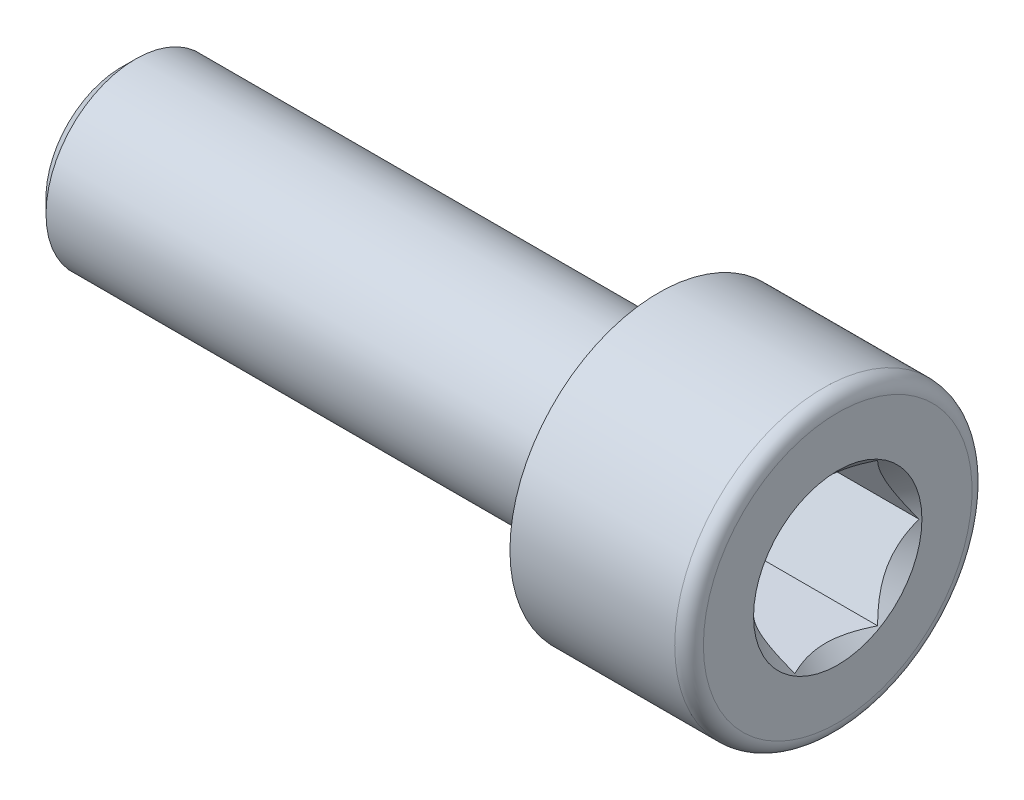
ISO-10303-21;
HEADER;
FILE_DESCRIPTION(('STEP AP214'),'2;1');
FILE_NAME('part.step','',(''),(''),'','','');
FILE_SCHEMA(('AUTOMOTIVE_DESIGN { 1 0 10303 214 1 1 1 1 }'));
ENDSEC;
DATA;
#1=APPLICATION_CONTEXT('core data for automotive mechanical design processes');
#2=APPLICATION_PROTOCOL_DEFINITION('international standard','automotive_design',2000,#1);
#3=PRODUCT_CONTEXT('',#1,'mechanical');
#4=PRODUCT('Part','Part','',(#3));
#5=PRODUCT_RELATED_PRODUCT_CATEGORY('part','',(#4));
#6=PRODUCT_DEFINITION_FORMATION('','',#4);
#7=PRODUCT_DEFINITION_CONTEXT('part definition',#1,'design');
#8=PRODUCT_DEFINITION('design','',#6,#7);
#9=PRODUCT_DEFINITION_SHAPE('','',#8);
#10=(LENGTH_UNIT() NAMED_UNIT(*) SI_UNIT(.MILLI.,.METRE.));
#11=(NAMED_UNIT(*) PLANE_ANGLE_UNIT() SI_UNIT($,.RADIAN.));
#12=(NAMED_UNIT(*) SI_UNIT($,.STERADIAN.) SOLID_ANGLE_UNIT());
#13=UNCERTAINTY_MEASURE_WITH_UNIT(LENGTH_MEASURE(1.E-05),#10,'distance_accuracy_value','');
#14=(GEOMETRIC_REPRESENTATION_CONTEXT(3) GLOBAL_UNCERTAINTY_ASSIGNED_CONTEXT((#13)) GLOBAL_UNIT_ASSIGNED_CONTEXT((#10,
#11,#12)) REPRESENTATION_CONTEXT('',''));
#15=CARTESIAN_POINT('',(0.,0.,0.));
#16=DIRECTION('',(0.,0.,1.));
#17=DIRECTION('',(1.,0.,0.));
#18=AXIS2_PLACEMENT_3D('',#15,#16,#17);
#19=CARTESIAN_POINT('',(-30.,0.,0.));
#20=DIRECTION('',(-1.,0.,0.));
#21=DIRECTION('',(0.,0.,1.));
#22=AXIS2_PLACEMENT_3D('',#19,#20,#21);
#23=CYLINDRICAL_SURFACE('',#22,2.5);
#24=CARTESIAN_POINT('',(-14.5999999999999,0.,0.));
#25=DIRECTION('',(1.,0.,0.));
#26=DIRECTION('',(0.,0.,-1.));
#27=AXIS2_PLACEMENT_3D('',#24,#25,#26);
#28=CIRCLE('',#27,2.5);
#29=CARTESIAN_POINT('',(-14.5999999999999,0.,2.49999999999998));
#30=VERTEX_POINT('',#29);
#31=EDGE_CURVE('E11',#30,#30,#28,.T.);
#32=CARTESIAN_POINT('',(0.,0.,0.));
#33=DIRECTION('',(-1.,0.,0.));
#34=DIRECTION('',(0.,0.,1.));
#35=AXIS2_PLACEMENT_3D('',#32,#33,#34);
#36=CIRCLE('',#35,2.5);
#37=CARTESIAN_POINT('',(0.,0.,2.49999999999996));
#38=VERTEX_POINT('',#37);
#39=EDGE_CURVE('E445',#38,#38,#36,.T.);
#40=CARTESIAN_POINT('',(-14.5999999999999,0.,2.49999999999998));
#41=CARTESIAN_POINT('',(-14.4479166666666,0.,2.49999999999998));
#42=CARTESIAN_POINT('',(-14.2958333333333,0.,2.49999999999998));
#43=CARTESIAN_POINT('',(-13.9916666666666,0.,2.49999999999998));
#44=CARTESIAN_POINT('',(-13.8395833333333,0.,2.49999999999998));
#45=CARTESIAN_POINT('',(-13.5354166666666,0.,2.49999999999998));
#46=CARTESIAN_POINT('',(-13.3833333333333,0.,2.49999999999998));
#47=CARTESIAN_POINT('',(-13.0791666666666,0.,2.49999999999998));
#48=CARTESIAN_POINT('',(-12.9270833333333,0.,2.49999999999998));
#49=CARTESIAN_POINT('',(-12.6229166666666,0.,2.49999999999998));
#50=CARTESIAN_POINT('',(-12.4708333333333,0.,2.49999999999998));
#51=CARTESIAN_POINT('',(-12.1666666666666,0.,2.49999999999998));
#52=CARTESIAN_POINT('',(-12.0145833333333,0.,2.49999999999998));
#53=CARTESIAN_POINT('',(-11.7104166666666,0.,2.49999999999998));
#54=CARTESIAN_POINT('',(-11.5583333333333,0.,2.49999999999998));
#55=CARTESIAN_POINT('',(-11.2541666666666,0.,2.49999999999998));
#56=CARTESIAN_POINT('',(-11.1020833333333,0.,2.49999999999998));
#57=CARTESIAN_POINT('',(-10.7979166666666,0.,2.49999999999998));
#58=CARTESIAN_POINT('',(-10.6458333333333,0.,2.49999999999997));
#59=CARTESIAN_POINT('',(-10.3416666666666,0.,2.49999999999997));
#60=CARTESIAN_POINT('',(-10.1895833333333,0.,2.49999999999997));
#61=CARTESIAN_POINT('',(-9.88541666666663,0.,2.49999999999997));
#62=CARTESIAN_POINT('',(-9.7333333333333,0.,2.49999999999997));
#63=CARTESIAN_POINT('',(-9.42916666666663,0.,2.49999999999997));
#64=CARTESIAN_POINT('',(-9.2770833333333,0.,2.49999999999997));
#65=CARTESIAN_POINT('',(-8.97291666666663,0.,2.49999999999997));
#66=CARTESIAN_POINT('',(-8.8208333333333,0.,2.49999999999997));
#67=CARTESIAN_POINT('',(-8.51666666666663,0.,2.49999999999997));
#68=CARTESIAN_POINT('',(-8.3645833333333,0.,2.49999999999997));
#69=CARTESIAN_POINT('',(-8.06041666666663,0.,2.49999999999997));
#70=CARTESIAN_POINT('',(-7.9083333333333,0.,2.49999999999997));
#71=CARTESIAN_POINT('',(-7.60416666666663,0.,2.49999999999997));
#72=CARTESIAN_POINT('',(-7.4520833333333,0.,2.49999999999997));
#73=CARTESIAN_POINT('',(-7.14791666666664,0.,2.49999999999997));
#74=CARTESIAN_POINT('',(-6.9958333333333,0.,2.49999999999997));
#75=CARTESIAN_POINT('',(-6.69166666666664,0.,2.49999999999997));
#76=CARTESIAN_POINT('',(-6.53958333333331,0.,2.49999999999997));
#77=CARTESIAN_POINT('',(-6.23541666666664,0.,2.49999999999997));
#78=CARTESIAN_POINT('',(-6.08333333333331,0.,2.49999999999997));
#79=CARTESIAN_POINT('',(-5.77916666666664,0.,2.49999999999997));
#80=CARTESIAN_POINT('',(-5.62708333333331,0.,2.49999999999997));
#81=CARTESIAN_POINT('',(-5.32291666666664,0.,2.49999999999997));
#82=CARTESIAN_POINT('',(-5.17083333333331,0.,2.49999999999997));
#83=CARTESIAN_POINT('',(-4.86666666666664,0.,2.49999999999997));
#84=CARTESIAN_POINT('',(-4.71458333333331,0.,2.49999999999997));
#85=CARTESIAN_POINT('',(-4.41041666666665,0.,2.49999999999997));
#86=CARTESIAN_POINT('',(-4.25833333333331,0.,2.49999999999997));
#87=CARTESIAN_POINT('',(-3.95416666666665,0.,2.49999999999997));
#88=CARTESIAN_POINT('',(-3.80208333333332,0.,2.49999999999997));
#89=CARTESIAN_POINT('',(-3.49791666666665,0.,2.49999999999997));
#90=CARTESIAN_POINT('',(-3.34583333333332,0.,2.49999999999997));
#91=CARTESIAN_POINT('',(-3.04166666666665,0.,2.49999999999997));
#92=CARTESIAN_POINT('',(-2.88958333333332,0.,2.49999999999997));
#93=CARTESIAN_POINT('',(-2.58541666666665,0.,2.49999999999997));
#94=CARTESIAN_POINT('',(-2.43333333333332,0.,2.49999999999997));
#95=CARTESIAN_POINT('',(-2.12916666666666,0.,2.49999999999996));
#96=CARTESIAN_POINT('',(-1.97708333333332,0.,2.49999999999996));
#97=CARTESIAN_POINT('',(-1.67291666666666,0.,2.49999999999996));
#98=CARTESIAN_POINT('',(-1.52083333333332,0.,2.49999999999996));
#99=CARTESIAN_POINT('',(-1.21666666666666,0.,2.49999999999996));
#100=CARTESIAN_POINT('',(-1.06458333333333,0.,2.49999999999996));
#101=CARTESIAN_POINT('',(-0.76041666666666,0.,2.49999999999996));
#102=CARTESIAN_POINT('',(-0.608333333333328,0.,2.49999999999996));
#103=CARTESIAN_POINT('',(-0.304166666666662,0.,2.49999999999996));
#104=CARTESIAN_POINT('',(-0.152083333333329,0.,2.49999999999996));
#105=CARTESIAN_POINT('',(0.,0.,2.49999999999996));
#106=B_SPLINE_CURVE_WITH_KNOTS('',3,(#40,#41,#42,#43,#44,#45,#46,#47,#48,#49,#50,#51,#52,#53,
#54,#55,#56,#57,#58,#59,#60,#61,#62,#63,#64,#65,#66,#67,#68,#69,#70,#71,#72,#73,#74,#75,#76,#77,
#78,#79,#80,#81,#82,#83,#84,#85,#86,#87,#88,#89,#90,#91,#92,#93,#94,#95,#96,#97,#98,#99,#100,
#101,#102,#103,#104,#105),.UNSPECIFIED.,.F.,.F.,(4,2,2,2,2,2,2,2,2,2,2,2,2,2,2,2,2,2,2,2,2,2,2,
2,2,2,2,2,2,2,2,2,4),(0.,0.456249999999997,0.912499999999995,1.36874999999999,1.82499999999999,
2.28124999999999,2.73749999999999,3.19374999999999,3.64999999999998,4.10624999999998,
4.56249999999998,5.01874999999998,5.47499999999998,5.93124999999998,6.38749999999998,
6.84374999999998,7.29999999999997,7.75624999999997,8.21249999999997,8.66874999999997,
9.12499999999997,9.58124999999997,10.0375,10.49375,10.95,11.40625,11.8625,12.31875,12.775,
13.23125,13.6875,14.1437499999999,14.5999999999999),.UNSPECIFIED.);
#107=EDGE_CURVE('BSEAM348',#30,#38,#106,.T.);
#108=ORIENTED_EDGE('',*,*,#31,.T.);
#109=ORIENTED_EDGE('',*,*,#39,.T.);
#110=ORIENTED_EDGE('',*,*,#107,.T.);
#111=ORIENTED_EDGE('',*,*,#107,.F.);
#112=EDGE_LOOP('',(#108,#110,#109,#111));
#113=FACE_BOUND('',#112,.T.);
#114=ADVANCED_FACE('F348',(#113),#23,.T.);
#115=CARTESIAN_POINT('',(-14.9999999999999,0.,0.));
#116=DIRECTION('',(1.,0.,0.));
#117=DIRECTION('',(0.,0.,-1.));
#118=AXIS2_PLACEMENT_3D('',#115,#116,#117);
#119=PLANE('',#118);
#120=CARTESIAN_POINT('',(-14.9999999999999,0.,0.));
#121=DIRECTION('',(1.,0.,0.));
#122=DIRECTION('',(0.,0.,-1.));
#123=AXIS2_PLACEMENT_3D('',#120,#121,#122);
#124=CIRCLE('',#123,2.1);
#125=CARTESIAN_POINT('',(-14.9999999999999,0.,-2.1));
#126=VERTEX_POINT('',#125);
#127=EDGE_CURVE('E355',#126,#126,#124,.F.);
#128=ORIENTED_EDGE('',*,*,#127,.T.);
#129=EDGE_LOOP('',(#128));
#130=FACE_BOUND('',#129,.T.);
#131=ADVANCED_FACE('F506',(#130),#119,.F.);
#132=CARTESIAN_POINT('',(4.65000000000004,0.,0.));
#133=DIRECTION('',(1.,0.,0.));
#134=DIRECTION('',(0.,0.,-1.));
#135=AXIS2_PLACEMENT_3D('',#132,#133,#134);
#136=CONICAL_SURFACE('',#135,2.,0.785398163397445);
#137=CARTESIAN_POINT('',(4.99999999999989,0.,0.));
#138=DIRECTION('',(-1.,0.,0.));
#139=DIRECTION('',(0.,0.,1.));
#140=AXIS2_PLACEMENT_3D('',#137,#138,#139);
#141=CIRCLE('',#140,2.35);
#142=CARTESIAN_POINT('',(4.99999999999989,0.,2.35));
#143=VERTEX_POINT('',#142);
#144=EDGE_CURVE('E457',#143,#143,#141,.T.);
#145=ORIENTED_EDGE('',*,*,#144,.F.);
#146=EDGE_LOOP('',(#145));
#147=FACE_BOUND('',#146,.T.);
#148=CARTESIAN_POINT('',(4.95951655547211,-2.0001999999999,1.15458506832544));
#149=CARTESIAN_POINT('',(4.91985416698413,-1.93144696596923,1.19427965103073));
#150=CARTESIAN_POINT('',(4.88252105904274,-1.86154425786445,1.23463799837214));
#151=CARTESIAN_POINT('',(4.81416476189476,-1.71900475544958,1.31693321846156));
#152=CARTESIAN_POINT('',(4.78317961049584,-1.64635440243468,1.35887791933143));
#153=CARTESIAN_POINT('',(4.73010129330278,-1.49985839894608,1.44345742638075));
#154=CARTESIAN_POINT('',(4.70787470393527,-1.42605006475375,1.48607068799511));
#155=CARTESIAN_POINT('',(4.67362989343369,-1.27680836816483,1.5722354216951));
#156=CARTESIAN_POINT('',(4.66158610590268,-1.20137956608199,1.61578426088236));
#157=CARTESIAN_POINT('',(4.65071958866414,-1.07138449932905,1.69083694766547));
#158=CARTESIAN_POINT('',(4.64911083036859,-1.01698621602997,1.7222438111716));
#159=CARTESIAN_POINT('',(4.65181995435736,-0.908278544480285,1.78500621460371));
#160=CARTESIAN_POINT('',(4.65613991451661,-0.853969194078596,1.81636173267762));
#161=CARTESIAN_POINT('',(4.67046064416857,-0.745863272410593,1.87877671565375));
#162=CARTESIAN_POINT('',(4.68046776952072,-0.69206734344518,1.90983580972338));
#163=CARTESIAN_POINT('',(4.7056135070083,-0.585405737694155,1.97141691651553));
#164=CARTESIAN_POINT('',(4.72075172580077,-0.532539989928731,2.00193897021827));
#165=CARTESIAN_POINT('',(4.76569558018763,-0.397120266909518,2.08012358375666));
#166=CARTESIAN_POINT('',(4.79888991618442,-0.315406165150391,2.12730124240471));
#167=CARTESIAN_POINT('',(4.85492689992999,-0.195252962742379,2.19667172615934));
#168=CARTESIAN_POINT('',(4.87461577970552,-0.155657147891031,2.21953238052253));
#169=CARTESIAN_POINT('',(4.91578839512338,-0.0771990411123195,2.26483018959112));
#170=CARTESIAN_POINT('',(4.93727102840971,-0.0383363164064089,2.28726759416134));
#171=CARTESIAN_POINT('',(4.95951655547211,0.000199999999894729,2.30951654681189));
#172=B_SPLINE_CURVE_WITH_KNOTS('',3,(#148,#149,#150,#151,#152,#153,#154,#155,#156,#157,#158,
#159,#160,#161,#162,#163,#164,#165,#166,#167,#168,#169,#170,#171),.UNSPECIFIED.,.F.,.F.,(4,2,2,
2,2,2,2,2,2,2,2,4),(0.,0.266420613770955,0.534393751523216,0.798110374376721,1.06116288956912,
1.24939906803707,1.43770123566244,1.62621426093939,1.81471283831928,2.11415604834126,
2.26347170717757,2.4126962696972),.UNSPECIFIED.);
#173=CARTESIAN_POINT('',(4.95940107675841,-2.,1.15470053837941));
#174=VERTEX_POINT('',#173);
#175=CARTESIAN_POINT('',(4.95940107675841,-2.22044604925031E-13,2.30940107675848));
#176=VERTEX_POINT('',#175);
#177=EDGE_CURVE('E460',#174,#176,#172,.T.);
#178=ORIENTED_EDGE('',*,*,#177,.T.);
#179=CARTESIAN_POINT('',(4.95951655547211,-0.000200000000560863,2.30951654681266));
#180=CARTESIAN_POINT('',(4.91985416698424,0.0685530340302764,2.2698219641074));
#181=CARTESIAN_POINT('',(4.88252105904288,0.13845574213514,2.22946361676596));
#182=CARTESIAN_POINT('',(4.81416476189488,0.280995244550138,2.14716839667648));
#183=CARTESIAN_POINT('',(4.78317961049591,0.353645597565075,2.10522369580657));
#184=CARTESIAN_POINT('',(4.73010129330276,0.500141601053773,2.02064418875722));
#185=CARTESIAN_POINT('',(4.70787470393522,0.573949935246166,1.97803092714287));
#186=CARTESIAN_POINT('',(4.67362989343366,0.723191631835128,1.89186619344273));
#187=CARTESIAN_POINT('',(4.6615861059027,0.798620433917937,1.8483173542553));
#188=CARTESIAN_POINT('',(4.65071958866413,0.928615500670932,1.77326466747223));
#189=CARTESIAN_POINT('',(4.64911083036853,0.98301378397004,1.74185780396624));
#190=CARTESIAN_POINT('',(4.65181995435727,1.09172145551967,1.67909540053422));
#191=CARTESIAN_POINT('',(4.65613991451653,1.14603080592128,1.64773988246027));
#192=CARTESIAN_POINT('',(4.67046064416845,1.25413672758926,1.58532489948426));
#193=CARTESIAN_POINT('',(4.68046776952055,1.30793265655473,1.5542658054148));
#194=CARTESIAN_POINT('',(4.70561350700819,1.41459426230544,1.49268469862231));
#195=CARTESIAN_POINT('',(4.72075172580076,1.46746001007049,1.46216264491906));
#196=CARTESIAN_POINT('',(4.76569558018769,1.60287973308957,1.38397803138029));
#197=CARTESIAN_POINT('',(4.79888991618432,1.68459383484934,1.33680037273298));
#198=CARTESIAN_POINT('',(4.85492689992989,1.80474703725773,1.26742988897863));
#199=CARTESIAN_POINT('',(4.87461577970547,1.8443428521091,1.2445692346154));
#200=CARTESIAN_POINT('',(4.91578839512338,1.92280095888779,1.19927142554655));
#201=CARTESIAN_POINT('',(4.93727102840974,1.96166368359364,1.17683402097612));
#202=CARTESIAN_POINT('',(4.95951655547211,2.0001999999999,1.15458506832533));
#203=B_SPLINE_CURVE_WITH_KNOTS('',3,(#179,#180,#181,#182,#183,#184,#185,#186,#187,#188,#189,
#190,#191,#192,#193,#194,#195,#196,#197,#198,#199,#200,#201,#202),.UNSPECIFIED.,.F.,.F.,(4,2,2,
2,2,2,2,2,2,2,2,4),(0.,0.266420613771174,0.534393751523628,0.798110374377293,1.06116288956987,
1.24939906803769,1.43770123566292,1.62621426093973,1.81471283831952,2.11415604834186,
2.26347170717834,2.41269626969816),.UNSPECIFIED.);
#204=CARTESIAN_POINT('',(4.95940107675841,1.99999999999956,1.15470053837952));
#205=VERTEX_POINT('',#204);
#206=EDGE_CURVE('E362',#176,#205,#203,.T.);
#207=ORIENTED_EDGE('',*,*,#206,.T.);
#208=CARTESIAN_POINT('',(5.79426069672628,1.99999999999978,-2.42618534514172));
#209=CARTESIAN_POINT('',(5.74909013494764,1.99999999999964,-2.36763258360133));
#210=CARTESIAN_POINT('',(5.70431975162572,1.99999999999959,-2.30876620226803));
#211=CARTESIAN_POINT('',(5.61576271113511,1.99999999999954,-2.19027734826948));
#212=CARTESIAN_POINT('',(5.57197628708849,1.99999999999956,-2.13065470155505));
#213=CARTESIAN_POINT('',(5.48525899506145,1.99999999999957,-2.01008896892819));
#214=CARTESIAN_POINT('',(5.44233732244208,1.99999999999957,-1.94913924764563));
#215=CARTESIAN_POINT('',(5.35797202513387,1.99999999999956,-1.82622867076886));
#216=CARTESIAN_POINT('',(5.31652829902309,1.99999999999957,-1.76426788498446));
#217=CARTESIAN_POINT('',(5.23284053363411,1.99999999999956,-1.6351265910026));
#218=CARTESIAN_POINT('',(5.19071746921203,1.99999999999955,-1.56786729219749));
#219=CARTESIAN_POINT('',(5.10907589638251,1.99999999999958,-1.43178830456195));
#220=CARTESIAN_POINT('',(5.06955704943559,1.99999999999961,-1.36296882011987));
#221=CARTESIAN_POINT('',(4.99394415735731,1.99999999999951,-1.22371704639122));
#222=CARTESIAN_POINT('',(4.95784054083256,1.99999999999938,-1.15328999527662));
#223=CARTESIAN_POINT('',(4.8898737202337,1.99999999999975,-1.01043480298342));
#224=CARTESIAN_POINT('',(4.85800850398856,2.00000000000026,-0.938007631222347));
#225=CARTESIAN_POINT('',(4.80263091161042,2.00000000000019,-0.798432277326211));
#226=CARTESIAN_POINT('',(4.77859946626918,1.99999999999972,-0.731492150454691));
#227=CARTESIAN_POINT('',(4.73589336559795,1.9999999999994,-0.595892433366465));
#228=CARTESIAN_POINT('',(4.7172190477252,1.99999999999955,-0.527232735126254));
#229=CARTESIAN_POINT('',(4.68655509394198,1.99999999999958,-0.389808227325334));
#230=CARTESIAN_POINT('',(4.67444297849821,1.99999999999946,-0.321071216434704));
#231=CARTESIAN_POINT('',(4.65715855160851,1.99999999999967,-0.182725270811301));
#232=CARTESIAN_POINT('',(4.65198475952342,2.00000000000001,-0.113116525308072));
#233=CARTESIAN_POINT('',(4.64902612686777,2.,0.023129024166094));
#234=CARTESIAN_POINT('',(4.65091987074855,1.99999999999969,0.0897588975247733));
#235=CARTESIAN_POINT('',(4.66125026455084,1.99999999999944,0.222505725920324));
#236=CARTESIAN_POINT('',(4.66968750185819,1.99999999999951,0.288622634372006));
#237=CARTESIAN_POINT('',(4.69276803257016,1.99999999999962,0.420987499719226));
#238=CARTESIAN_POINT('',(4.70752150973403,1.99999999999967,0.487215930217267));
#239=CARTESIAN_POINT('',(4.74241355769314,1.99999999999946,0.618207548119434));
#240=CARTESIAN_POINT('',(4.7625518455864,1.99999999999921,0.682970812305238));
#241=CARTESIAN_POINT('',(4.8320405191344,1.99999999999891,0.881622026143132));
#242=CARTESIAN_POINT('',(4.88907995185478,1.99999999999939,1.01281050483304));
#243=CARTESIAN_POINT('',(5.01602570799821,1.99999999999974,1.26907436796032));
#244=CARTESIAN_POINT('',(5.08597723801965,1.99999999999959,1.39412625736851));
#245=CARTESIAN_POINT('',(5.19522880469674,1.99999999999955,1.57489943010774));
#246=CARTESIAN_POINT('',(5.23135733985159,1.99999999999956,1.63257625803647));
#247=CARTESIAN_POINT('',(5.30516118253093,1.99999999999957,1.7469394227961));
#248=CARTESIAN_POINT('',(5.34283660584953,1.99999999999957,1.80362568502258));
#249=CARTESIAN_POINT('',(5.41914526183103,1.99999999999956,1.91568151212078));
#250=CARTESIAN_POINT('',(5.45776839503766,1.99999999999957,1.97105798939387));
#251=CARTESIAN_POINT('',(5.53605164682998,1.99999999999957,2.08105092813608));
#252=CARTESIAN_POINT('',(5.57571147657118,1.99999999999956,2.13566759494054));
#253=CARTESIAN_POINT('',(5.61579652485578,1.99999999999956,2.18996553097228));
#254=B_SPLINE_CURVE_WITH_KNOTS('',3,(#208,#209,#210,#211,#212,#213,#214,#215,#216,#217,#218,
#219,#220,#221,#222,#223,#224,#225,#226,#227,#228,#229,#230,#231,#232,#233,#234,#235,#236,#237,
#238,#239,#240,#241,#242,#243,#244,#245,#246,#247,#248,#249,#250,#251,#252,#253),.UNSPECIFIED.,
.F.,.F.,(4,2,2,2,2,2,2,2,2,2,2,2,2,2,2,2,2,2,2,2,2,2,4),(0.,0.221858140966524,0.443768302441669,
0.66738883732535,0.890993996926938,1.12903048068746,1.36703595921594,1.6043533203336,
1.84155761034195,2.05474341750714,2.26794265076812,2.47701207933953,2.68603688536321,
2.88567400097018,3.08532903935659,3.28861875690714,3.49189779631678,3.91981303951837,
4.34925589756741,4.55341049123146,4.75758039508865,4.96011357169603,5.16259090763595),.UNSPECIFIED.);
#255=CARTESIAN_POINT('',(4.95940107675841,1.99999999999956,-1.15470053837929));
#256=VERTEX_POINT('',#255);
#257=EDGE_CURVE('E496',#205,#256,#254,.F.);
#258=ORIENTED_EDGE('',*,*,#257,.T.);
#259=CARTESIAN_POINT('',(4.95951655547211,2.00019999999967,-1.15458506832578));
#260=CARTESIAN_POINT('',(4.91985416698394,1.93144696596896,-1.19427965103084));
#261=CARTESIAN_POINT('',(4.88252105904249,1.86154425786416,-1.23463799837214));
#262=CARTESIAN_POINT('',(4.81416476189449,1.71900475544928,-1.31693321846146));
#263=CARTESIAN_POINT('',(4.78317961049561,1.6463544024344,-1.35887791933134));
#264=CARTESIAN_POINT('',(4.73010129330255,1.49985839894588,-1.44345742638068));
#265=CARTESIAN_POINT('',(4.70787470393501,1.42605006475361,-1.48607068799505));
#266=CARTESIAN_POINT('',(4.67362989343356,1.27680836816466,-1.5722354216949));
#267=CARTESIAN_POINT('',(4.66158610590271,1.20137956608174,-1.61578426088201));
#268=CARTESIAN_POINT('',(4.65071958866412,1.07138449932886,-1.69083694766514));
#269=CARTESIAN_POINT('',(4.64911083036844,1.01698621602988,-1.72224381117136));
#270=CARTESIAN_POINT('',(4.65181995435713,0.908278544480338,-1.78500621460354));
#271=CARTESIAN_POINT('',(4.65613991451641,0.853969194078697,-1.81636173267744));
#272=CARTESIAN_POINT('',(4.67046064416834,0.745863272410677,-1.87877671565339));
#273=CARTESIAN_POINT('',(4.68046776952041,0.692067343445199,-1.90983580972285));
#274=CARTESIAN_POINT('',(4.7056135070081,0.585405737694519,-1.9714169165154));
#275=CARTESIAN_POINT('',(4.72075172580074,0.532539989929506,-2.0019389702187));
#276=CARTESIAN_POINT('',(4.76569558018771,0.397120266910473,-2.08012358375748));
#277=CARTESIAN_POINT('',(4.79888991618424,0.315406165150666,-2.1273012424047));
#278=CARTESIAN_POINT('',(4.85492689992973,0.195252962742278,-2.196671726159));
#279=CARTESIAN_POINT('',(4.87461577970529,0.155657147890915,-2.21953238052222));
#280=CARTESIAN_POINT('',(4.91578839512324,0.0771990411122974,-2.26483018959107));
#281=CARTESIAN_POINT('',(4.93727102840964,0.0383363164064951,-2.28726759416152));
#282=CARTESIAN_POINT('',(4.95951655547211,-0.000199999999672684,-2.30951654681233));
#283=B_SPLINE_CURVE_WITH_KNOTS('',3,(#259,#260,#261,#262,#263,#264,#265,#266,#267,#268,#269,
#270,#271,#272,#273,#274,#275,#276,#277,#278,#279,#280,#281,#282),.UNSPECIFIED.,.F.,.F.,(4,2,2,
2,2,2,2,2,2,2,2,4),(0.,0.266420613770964,0.534393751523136,0.798110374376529,1.06116288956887,
1.24939906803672,1.43770123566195,1.62621426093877,1.81471283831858,2.11415604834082,
2.26347170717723,2.41269626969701),.UNSPECIFIED.);
#284=CARTESIAN_POINT('',(4.95940107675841,2.22044604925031E-13,-2.30940107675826));
#285=VERTEX_POINT('',#284);
#286=EDGE_CURVE('E560',#256,#285,#283,.T.);
#287=ORIENTED_EDGE('',*,*,#286,.T.);
#288=CARTESIAN_POINT('',(4.95951655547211,0.000199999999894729,-2.30951654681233));
#289=CARTESIAN_POINT('',(4.91985416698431,-0.0685530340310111,-2.26982196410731));
#290=CARTESIAN_POINT('',(4.88252105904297,-0.138455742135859,-2.22946361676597));
#291=CARTESIAN_POINT('',(4.81416476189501,-0.280995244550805,-2.14716839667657));
#292=CARTESIAN_POINT('',(4.78317961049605,-0.353645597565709,-2.10522369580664));
#293=CARTESIAN_POINT('',(4.73010129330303,-0.500141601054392,-2.02064418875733));
#294=CARTESIAN_POINT('',(4.7078747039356,-0.573949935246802,-1.97803092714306));
#295=CARTESIAN_POINT('',(4.67362989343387,-0.723191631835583,-1.89186619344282));
#296=CARTESIAN_POINT('',(4.66158610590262,-0.798620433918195,-1.84831735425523));
#297=CARTESIAN_POINT('',(4.65071958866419,-0.928615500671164,-1.77326466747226));
#298=CARTESIAN_POINT('',(4.64911083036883,-0.983013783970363,-1.74185780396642));
#299=CARTESIAN_POINT('',(4.65181995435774,-1.09172145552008,-1.67909540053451));
#300=CARTESIAN_POINT('',(4.65613991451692,-1.14603080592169,-1.64773988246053));
#301=CARTESIAN_POINT('',(4.67046064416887,-1.25413672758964,-1.58532489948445));
#302=CARTESIAN_POINT('',(4.68046776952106,-1.30793265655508,-1.55426580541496));
#303=CARTESIAN_POINT('',(4.70561350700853,-1.41459426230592,-1.49268469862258));
#304=CARTESIAN_POINT('',(4.72075172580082,-1.46746001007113,-1.46216264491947));
#305=CARTESIAN_POINT('',(4.76569558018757,-1.60287973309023,-1.38397803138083));
#306=CARTESIAN_POINT('',(4.79888991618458,-1.68459383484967,-1.33680037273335));
#307=CARTESIAN_POINT('',(4.85492689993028,-1.80474703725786,-1.26742988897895));
#308=CARTESIAN_POINT('',(4.87461577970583,-1.84434285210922,-1.24456923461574));
#309=CARTESIAN_POINT('',(4.91578839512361,-1.92280095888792,-1.19927142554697));
#310=CARTESIAN_POINT('',(4.93727102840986,-1.96166368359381,-1.17683402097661));
#311=CARTESIAN_POINT('',(4.95951655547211,-2.00020000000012,-1.15458506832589));
#312=B_SPLINE_CURVE_WITH_KNOTS('',3,(#288,#289,#290,#291,#292,#293,#294,#295,#296,#297,#298,
#299,#300,#301,#302,#303,#304,#305,#306,#307,#308,#309,#310,#311),.UNSPECIFIED.,.F.,.F.,(4,2,2,
2,2,2,2,2,2,2,2,4),(0.,0.26642061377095,0.534393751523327,0.798110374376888,1.06116288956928,
1.24939906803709,1.43770123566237,1.62621426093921,1.81471283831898,2.1141560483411,
2.26347170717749,2.41269626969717),.UNSPECIFIED.);
#313=CARTESIAN_POINT('',(4.95940107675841,-2.,-1.15470053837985));
#314=VERTEX_POINT('',#313);
#315=EDGE_CURVE('E556',#285,#314,#312,.T.);
#316=ORIENTED_EDGE('',*,*,#315,.T.);
#317=CARTESIAN_POINT('',(5.7942607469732,-2.,-2.42618541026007));
#318=CARTESIAN_POINT('',(5.74909018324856,-2.,-2.36763264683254));
#319=CARTESIAN_POINT('',(5.70431979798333,-1.99999999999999,-2.30876626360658));
#320=CARTESIAN_POINT('',(5.61576275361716,-1.99999999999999,-2.19027740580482));
#321=CARTESIAN_POINT('',(5.57197632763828,-1.99999999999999,-2.13065475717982));
#322=CARTESIAN_POINT('',(5.48525903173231,-1.99999999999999,-2.01008902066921));
#323=CARTESIAN_POINT('',(5.44233735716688,-1.99999999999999,-1.94913929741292));
#324=CARTESIAN_POINT('',(5.35797205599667,-1.99999999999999,-1.82622871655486));
#325=CARTESIAN_POINT('',(5.31652832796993,-1.99999999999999,-1.76426792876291));
#326=CARTESIAN_POINT('',(5.23284055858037,-1.99999999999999,-1.63512663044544));
#327=CARTESIAN_POINT('',(5.19071749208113,-1.99999999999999,-1.56786732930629));
#328=CARTESIAN_POINT('',(5.10907591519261,-1.99999999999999,-1.43178833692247));
#329=CARTESIAN_POINT('',(5.06955706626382,-1.99999999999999,-1.36296885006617));
#330=CARTESIAN_POINT('',(4.99394417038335,-1.99999999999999,-1.22371707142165));
#331=CARTESIAN_POINT('',(4.95784055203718,-1.99999999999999,-1.15329001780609));
#332=CARTESIAN_POINT('',(4.88987372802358,-2.,-1.01043482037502));
#333=CARTESIAN_POINT('',(4.85800851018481,-2.,-0.938007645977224));
#334=CARTESIAN_POINT('',(4.80263091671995,-2.,-0.79843229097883));
#335=CARTESIAN_POINT('',(4.77859947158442,-1.99999999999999,-0.7314921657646));
#336=CARTESIAN_POINT('',(4.73589337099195,-2.,-0.595892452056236));
#337=CARTESIAN_POINT('',(4.71721905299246,-2.00000000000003,-0.527232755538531));
#338=CARTESIAN_POINT('',(4.68655509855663,-1.99999999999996,-0.389808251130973));
#339=CARTESIAN_POINT('',(4.67444298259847,-1.99999999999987,-0.321071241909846));
#340=CARTESIAN_POINT('',(4.65715855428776,-2.00000000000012,-0.182725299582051));
#341=CARTESIAN_POINT('',(4.6519847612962,-2.00000000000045,-0.113116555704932));
#342=CARTESIAN_POINT('',(4.6490261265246,-2.00000000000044,0.0231289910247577));
#343=CARTESIAN_POINT('',(4.65091986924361,-2.00000000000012,0.0897588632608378));
#344=CARTESIAN_POINT('',(4.66125026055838,-1.99999999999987,0.22250568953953));
#345=CARTESIAN_POINT('',(4.66968749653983,-1.99999999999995,0.288622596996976));
#346=CARTESIAN_POINT('',(4.69276802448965,-2.00000000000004,0.420987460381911));
#347=CARTESIAN_POINT('',(4.70752150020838,-2.00000000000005,0.487215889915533));
#348=CARTESIAN_POINT('',(4.74241354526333,-1.99999999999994,0.618207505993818));
#349=CARTESIAN_POINT('',(4.7625518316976,-1.99999999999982,0.682970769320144));
#350=CARTESIAN_POINT('',(4.83204049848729,-1.99999999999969,0.881621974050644));
#351=CARTESIAN_POINT('',(4.88907992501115,-1.99999999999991,1.01281044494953));
#352=CARTESIAN_POINT('',(5.01602566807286,-2.00000000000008,1.26907429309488));
#353=CARTESIAN_POINT('',(5.08597719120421,-2.00000000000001,1.39412617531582));
#354=CARTESIAN_POINT('',(5.19522874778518,-1.99999999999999,1.57489933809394));
#355=CARTESIAN_POINT('',(5.2313572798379,-1.99999999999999,1.63257616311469));
#356=CARTESIAN_POINT('',(5.30516111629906,-2.,1.74693932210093));
#357=CARTESIAN_POINT('',(5.34283653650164,-2.,1.803625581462));
#358=CARTESIAN_POINT('',(5.41914518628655,-1.99999999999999,1.91568140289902));
#359=CARTESIAN_POINT('',(5.45776831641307,-1.99999999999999,1.97105787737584));
#360=CARTESIAN_POINT('',(5.53605156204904,-2.,2.08105081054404));
#361=CARTESIAN_POINT('',(5.57571138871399,-2.,2.13566747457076));
#362=CARTESIAN_POINT('',(5.61579643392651,-2.,2.18996540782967));
#363=B_SPLINE_CURVE_WITH_KNOTS('',3,(#317,#318,#319,#320,#321,#322,#323,#324,#325,#326,#327,
#328,#329,#330,#331,#332,#333,#334,#335,#336,#337,#338,#339,#340,#341,#342,#343,#344,#345,#346,
#347,#348,#349,#350,#351,#352,#353,#354,#355,#356,#357,#358,#359,#360,#361,#362),.UNSPECIFIED.,
.F.,.F.,(4,2,2,2,2,2,2,2,2,2,2,2,2,2,2,2,2,2,2,2,2,2,4),(0.,0.221858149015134,0.443768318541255,
0.667388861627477,0.890994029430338,1.12903052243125,1.36703601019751,1.60435338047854,
1.8415576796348,2.05474348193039,2.26794271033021,2.47701213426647,2.68603693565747,
2.8856740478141,3.08532908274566,3.28861879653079,3.49189783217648,3.91981304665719,
4.3492558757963,4.55341045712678,4.75758034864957,4.96011351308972,5.16259083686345),.UNSPECIFIED.);
#364=EDGE_CURVE('E467',#314,#174,#363,.T.);
#365=ORIENTED_EDGE('',*,*,#364,.T.);
#366=EDGE_LOOP('',(#178,#207,#258,#287,#316,#365));
#367=FACE_BOUND('',#366,.T.);
#368=ADVANCED_FACE('F473',(#147,#367),#136,.F.);
#369=CARTESIAN_POINT('',(5.00000000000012,3.75000000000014,1.11022302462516E-13));
#370=DIRECTION('',(-1.,0.,0.));
#371=DIRECTION('',(0.,0.,1.));
#372=AXIS2_PLACEMENT_3D('',#369,#370,#371);
#373=PLANE('',#372);
#374=CARTESIAN_POINT('',(5.00000000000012,0.,0.));
#375=DIRECTION('',(-1.,0.,0.));
#376=DIRECTION('',(0.,0.,1.));
#377=AXIS2_PLACEMENT_3D('',#374,#375,#376);
#378=CIRCLE('',#377,3.75);
#379=CARTESIAN_POINT('',(5.00000000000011,0.,3.75));
#380=VERTEX_POINT('',#379);
#381=EDGE_CURVE('E454',#380,#380,#378,.T.);
#382=ORIENTED_EDGE('',*,*,#381,.F.);
#383=EDGE_LOOP('',(#382));
#384=FACE_BOUND('',#383,.T.);
#385=ORIENTED_EDGE('',*,*,#144,.T.);
#386=EDGE_LOOP('',(#385));
#387=FACE_BOUND('',#386,.T.);
#388=ADVANCED_FACE('F538',(#384,#387),#373,.F.);
#389=CARTESIAN_POINT('',(4.59999999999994,0.,0.));
#390=DIRECTION('',(-1.,0.,0.));
#391=DIRECTION('',(0.,0.,1.));
#392=AXIS2_PLACEMENT_3D('',#389,#390,#391);
#393=TOROIDAL_SURFACE('',#392,3.75,0.400000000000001);
#394=CARTESIAN_POINT('',(4.59999999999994,0.,0.));
#395=DIRECTION('',(-1.,0.,0.));
#396=DIRECTION('',(0.,0.,1.));
#397=AXIS2_PLACEMENT_3D('',#394,#395,#396);
#398=CIRCLE('',#397,4.15);
#399=CARTESIAN_POINT('',(4.59999999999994,0.,4.14999999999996));
#400=VERTEX_POINT('',#399);
#401=EDGE_CURVE('E451',#400,#400,#398,.T.);
#402=ORIENTED_EDGE('',*,*,#401,.F.);
#403=EDGE_LOOP('',(#402));
#404=FACE_BOUND('',#403,.T.);
#405=ORIENTED_EDGE('',*,*,#381,.T.);
#406=EDGE_LOOP('',(#405));
#407=FACE_BOUND('',#406,.T.);
#408=ADVANCED_FACE('F533',(#404,#407),#393,.T.);
#409=CARTESIAN_POINT('',(-30.,0.,0.));
#410=DIRECTION('',(-1.,0.,0.));
#411=DIRECTION('',(0.,0.,1.));
#412=AXIS2_PLACEMENT_3D('',#409,#410,#411);
#413=CYLINDRICAL_SURFACE('',#412,4.15);
#414=CARTESIAN_POINT('',(0.,0.,0.));
#415=DIRECTION('',(-1.,0.,0.));
#416=DIRECTION('',(0.,0.,1.));
#417=AXIS2_PLACEMENT_3D('',#414,#415,#416);
#418=CIRCLE('',#417,4.15);
#419=CARTESIAN_POINT('',(0.,0.,4.14999999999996));
#420=VERTEX_POINT('',#419);
#421=EDGE_CURVE('E448',#420,#420,#418,.T.);
#422=CARTESIAN_POINT('',(0.,0.,4.14999999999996));
#423=CARTESIAN_POINT('',(0.0479166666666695,0.,4.14999999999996));
#424=CARTESIAN_POINT('',(0.0958333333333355,0.,4.14999999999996));
#425=CARTESIAN_POINT('',(0.191666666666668,0.,4.14999999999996));
#426=CARTESIAN_POINT('',(0.239583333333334,0.,4.14999999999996));
#427=CARTESIAN_POINT('',(0.335416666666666,0.,4.14999999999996));
#428=CARTESIAN_POINT('',(0.383333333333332,0.,4.14999999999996));
#429=CARTESIAN_POINT('',(0.479166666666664,0.,4.14999999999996));
#430=CARTESIAN_POINT('',(0.52708333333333,0.,4.14999999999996));
#431=CARTESIAN_POINT('',(0.622916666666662,0.,4.14999999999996));
#432=CARTESIAN_POINT('',(0.670833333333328,0.,4.14999999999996));
#433=CARTESIAN_POINT('',(0.76666666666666,0.,4.14999999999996));
#434=CARTESIAN_POINT('',(0.814583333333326,0.,4.14999999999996));
#435=CARTESIAN_POINT('',(0.910416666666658,0.,4.14999999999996));
#436=CARTESIAN_POINT('',(0.958333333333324,0.,4.14999999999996));
#437=CARTESIAN_POINT('',(1.05416666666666,0.,4.14999999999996));
#438=CARTESIAN_POINT('',(1.10208333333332,0.,4.14999999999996));
#439=CARTESIAN_POINT('',(1.19791666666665,0.,4.14999999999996));
#440=CARTESIAN_POINT('',(1.24583333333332,0.,4.14999999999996));
#441=CARTESIAN_POINT('',(1.34166666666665,0.,4.14999999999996));
#442=CARTESIAN_POINT('',(1.38958333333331,0.,4.14999999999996));
#443=CARTESIAN_POINT('',(1.48541666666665,0.,4.14999999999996));
#444=CARTESIAN_POINT('',(1.53333333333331,0.,4.14999999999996));
#445=CARTESIAN_POINT('',(1.62916666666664,0.,4.14999999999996));
#446=CARTESIAN_POINT('',(1.67708333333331,0.,4.14999999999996));
#447=CARTESIAN_POINT('',(1.77291666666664,0.,4.14999999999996));
#448=CARTESIAN_POINT('',(1.82083333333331,0.,4.14999999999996));
#449=CARTESIAN_POINT('',(1.91666666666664,0.,4.14999999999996));
#450=CARTESIAN_POINT('',(1.96458333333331,0.,4.14999999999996));
#451=CARTESIAN_POINT('',(2.06041666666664,0.,4.14999999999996));
#452=CARTESIAN_POINT('',(2.1083333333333,0.,4.14999999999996));
#453=CARTESIAN_POINT('',(2.20416666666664,0.,4.14999999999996));
#454=CARTESIAN_POINT('',(2.2520833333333,0.,4.14999999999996));
#455=CARTESIAN_POINT('',(2.34791666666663,0.,4.14999999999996));
#456=CARTESIAN_POINT('',(2.3958333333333,0.,4.14999999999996));
#457=CARTESIAN_POINT('',(2.49166666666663,0.,4.14999999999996));
#458=CARTESIAN_POINT('',(2.5395833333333,0.,4.14999999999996));
#459=CARTESIAN_POINT('',(2.63541666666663,0.,4.14999999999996));
#460=CARTESIAN_POINT('',(2.6833333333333,0.,4.14999999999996));
#461=CARTESIAN_POINT('',(2.77916666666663,0.,4.14999999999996));
#462=CARTESIAN_POINT('',(2.82708333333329,0.,4.14999999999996));
#463=CARTESIAN_POINT('',(2.92291666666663,0.,4.14999999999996));
#464=CARTESIAN_POINT('',(2.97083333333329,0.,4.14999999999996));
#465=CARTESIAN_POINT('',(3.06666666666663,0.,4.14999999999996));
#466=CARTESIAN_POINT('',(3.11458333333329,0.,4.14999999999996));
#467=CARTESIAN_POINT('',(3.21041666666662,0.,4.14999999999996));
#468=CARTESIAN_POINT('',(3.25833333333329,0.,4.14999999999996));
#469=CARTESIAN_POINT('',(3.35416666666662,0.,4.14999999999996));
#470=CARTESIAN_POINT('',(3.40208333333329,0.,4.14999999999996));
#471=CARTESIAN_POINT('',(3.49791666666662,0.,4.14999999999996));
#472=CARTESIAN_POINT('',(3.54583333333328,0.,4.14999999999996));
#473=CARTESIAN_POINT('',(3.64166666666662,0.,4.14999999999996));
#474=CARTESIAN_POINT('',(3.68958333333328,0.,4.14999999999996));
#475=CARTESIAN_POINT('',(3.78541666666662,0.,4.14999999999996));
#476=CARTESIAN_POINT('',(3.83333333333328,0.,4.14999999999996));
#477=CARTESIAN_POINT('',(3.92916666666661,0.,4.14999999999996));
#478=CARTESIAN_POINT('',(3.97708333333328,0.,4.14999999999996));
#479=CARTESIAN_POINT('',(4.07291666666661,0.,4.14999999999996));
#480=CARTESIAN_POINT('',(4.12083333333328,0.,4.14999999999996));
#481=CARTESIAN_POINT('',(4.21666666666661,0.,4.14999999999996));
#482=CARTESIAN_POINT('',(4.26458333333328,0.,4.14999999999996));
#483=CARTESIAN_POINT('',(4.36041666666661,0.,4.14999999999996));
#484=CARTESIAN_POINT('',(4.40833333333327,0.,4.14999999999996));
#485=CARTESIAN_POINT('',(4.50416666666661,0.,4.14999999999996));
#486=CARTESIAN_POINT('',(4.55208333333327,0.,4.14999999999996));
#487=CARTESIAN_POINT('',(4.59999999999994,0.,4.14999999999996));
#488=B_SPLINE_CURVE_WITH_KNOTS('',3,(#422,#423,#424,#425,#426,#427,#428,#429,#430,#431,#432,
#433,#434,#435,#436,#437,#438,#439,#440,#441,#442,#443,#444,#445,#446,#447,#448,#449,#450,#451,
#452,#453,#454,#455,#456,#457,#458,#459,#460,#461,#462,#463,#464,#465,#466,#467,#468,#469,#470,
#471,#472,#473,#474,#475,#476,#477,#478,#479,#480,#481,#482,#483,#484,#485,#486,#487),
.UNSPECIFIED.,.F.,.F.,(4,2,2,2,2,2,2,2,2,2,2,2,2,2,2,2,2,2,2,2,2,2,2,2,2,2,2,2,2,2,2,2,4),(0.,
0.143749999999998,0.287499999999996,0.431249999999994,0.574999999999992,0.71874999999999,
0.862499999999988,1.00624999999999,1.14999999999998,1.29374999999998,1.43749999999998,
1.58124999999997,1.72499999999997,1.86874999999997,2.01249999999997,2.15624999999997,
2.29999999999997,2.44374999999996,2.58749999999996,2.73124999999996,2.87499999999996,
3.01874999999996,3.16249999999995,3.30624999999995,3.44999999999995,3.59374999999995,
3.73749999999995,3.88124999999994,4.02499999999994,4.16874999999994,4.31249999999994,
4.45624999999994,4.59999999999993),.UNSPECIFIED.);
#489=EDGE_CURVE('BSEAM528',#420,#400,#488,.T.);
#490=ORIENTED_EDGE('',*,*,#421,.F.);
#491=ORIENTED_EDGE('',*,*,#401,.T.);
#492=ORIENTED_EDGE('',*,*,#489,.T.);
#493=ORIENTED_EDGE('',*,*,#489,.F.);
#494=EDGE_LOOP('',(#490,#492,#491,#493));
#495=FACE_BOUND('',#494,.T.);
#496=ADVANCED_FACE('F528',(#495),#413,.T.);
#497=CARTESIAN_POINT('',(0.,2.4999999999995,1.11022302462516E-13));
#498=DIRECTION('',(1.,0.,0.));
#499=DIRECTION('',(0.,0.,-1.));
#500=AXIS2_PLACEMENT_3D('',#497,#498,#499);
#501=PLANE('',#500);
#502=ORIENTED_EDGE('',*,*,#39,.F.);
#503=EDGE_LOOP('',(#502));
#504=FACE_BOUND('',#503,.T.);
#505=ORIENTED_EDGE('',*,*,#421,.T.);
#506=EDGE_LOOP('',(#505));
#507=FACE_BOUND('',#506,.T.);
#508=ADVANCED_FACE('F488',(#504,#507),#501,.F.);
#509=CARTESIAN_POINT('',(1.50000000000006,1.99999999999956,1.15470053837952));
#510=DIRECTION('',(-1.,0.,0.));
#511=DIRECTION('',(0.,0.,1.));
#512=AXIS2_PLACEMENT_3D('',#509,#510,#511);
#513=PLANE('',#512);
#514=DIRECTION('',(0.,-0.866025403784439,0.499999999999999));
#515=VECTOR('',#514,1.);
#516=CARTESIAN_POINT('',(1.50000000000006,1.99999999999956,1.15470053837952));
#517=LINE('',#516,#515);
#518=CARTESIAN_POINT('',(1.50000000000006,1.99999999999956,1.15470053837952));
#519=VERTEX_POINT('',#518);
#520=CARTESIAN_POINT('',(1.50000000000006,-2.22044604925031E-13,2.30940107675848));
#521=VERTEX_POINT('',#520);
#522=EDGE_CURVE('E403',#519,#521,#517,.T.);
#523=ORIENTED_EDGE('',*,*,#522,.T.);
#524=DIRECTION('',(0.,-0.86602540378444,-0.500000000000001));
#525=VECTOR('',#524,1.);
#526=CARTESIAN_POINT('',(1.50000000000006,-2.22044604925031E-13,2.30940107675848));
#527=LINE('',#526,#525);
#528=CARTESIAN_POINT('',(1.50000000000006,-2.,1.15470053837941));
#529=VERTEX_POINT('',#528);
#530=EDGE_CURVE('E411',#521,#529,#527,.T.);
#531=ORIENTED_EDGE('',*,*,#530,.T.);
#532=DIRECTION('',(0.,0.,-0.999999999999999));
#533=VECTOR('',#532,1.);
#534=CARTESIAN_POINT('',(1.50000000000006,-2.,1.15470053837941));
#535=LINE('',#534,#533);
#536=CARTESIAN_POINT('',(1.50000000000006,-1.99999999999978,-1.15470053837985));
#537=VERTEX_POINT('',#536);
#538=EDGE_CURVE('E417',#529,#537,#535,.T.);
#539=ORIENTED_EDGE('',*,*,#538,.T.);
#540=DIRECTION('',(0.,0.86602540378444,-0.499999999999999));
#541=VECTOR('',#540,1.);
#542=CARTESIAN_POINT('',(1.50000000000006,-1.99999999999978,-1.15470053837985));
#543=LINE('',#542,#541);
#544=CARTESIAN_POINT('',(1.50000000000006,2.22044604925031E-13,-2.30940107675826));
#545=VERTEX_POINT('',#544);
#546=EDGE_CURVE('E426',#537,#545,#543,.T.);
#547=ORIENTED_EDGE('',*,*,#546,.T.);
#548=DIRECTION('',(0.,0.86602540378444,0.5));
#549=VECTOR('',#548,1.);
#550=CARTESIAN_POINT('',(1.50000000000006,2.22044604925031E-13,-2.30940107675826));
#551=LINE('',#550,#549);
#552=CARTESIAN_POINT('',(1.50000000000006,1.99999999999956,-1.15470053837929));
#553=VERTEX_POINT('',#552);
#554=EDGE_CURVE('E429',#545,#553,#551,.T.);
#555=ORIENTED_EDGE('',*,*,#554,.T.);
#556=DIRECTION('',(0.,0.,1.));
#557=VECTOR('',#556,1.);
#558=CARTESIAN_POINT('',(1.50000000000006,1.99999999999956,-1.15470053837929));
#559=LINE('',#558,#557);
#560=EDGE_CURVE('E408',#553,#519,#559,.T.);
#561=ORIENTED_EDGE('',*,*,#560,.T.);
#562=EDGE_LOOP('',(#523,#531,#539,#547,#555,#561));
#563=FACE_BOUND('',#562,.T.);
#564=CARTESIAN_POINT('',(1.50000000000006,0.,0.));
#565=DIRECTION('',(-1.,0.,0.));
#566=DIRECTION('',(0.,0.,1.));
#567=AXIS2_PLACEMENT_3D('',#564,#565,#566);
#568=CIRCLE('',#567,1.82679491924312);
#569=CARTESIAN_POINT('',(1.50000000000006,0.,1.82679491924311));
#570=VERTEX_POINT('',#569);
#571=EDGE_CURVE('E434',#570,#570,#568,.F.);
#572=ORIENTED_EDGE('',*,*,#571,.F.);
#573=EDGE_LOOP('',(#572));
#574=FACE_BOUND('',#573,.T.);
#575=ADVANCED_FACE('F419',(#563,#574),#513,.F.);
#576=CARTESIAN_POINT('',(1.50000000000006,1.99999999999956,1.15470053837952));
#577=DIRECTION('',(0.,0.500000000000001,0.866025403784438));
#578=DIRECTION('',(0.,-0.866025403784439,0.499999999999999));
#579=AXIS2_PLACEMENT_3D('',#576,#577,#578);
#580=PLANE('',#579);
#581=ORIENTED_EDGE('',*,*,#206,.F.);
#582=DIRECTION('',(1.,0.,0.));
#583=VECTOR('',#582,1.);
#584=CARTESIAN_POINT('',(1.50000000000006,-2.22044604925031E-13,2.30940107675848));
#585=LINE('',#584,#583);
#586=EDGE_CURVE('E399',#521,#176,#585,.T.);
#587=ORIENTED_EDGE('',*,*,#586,.F.);
#588=ORIENTED_EDGE('',*,*,#522,.F.);
#589=DIRECTION('',(1.,0.,0.));
#590=VECTOR('',#589,1.);
#591=CARTESIAN_POINT('',(1.50000000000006,1.99999999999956,1.15470053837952));
#592=LINE('',#591,#590);
#593=EDGE_CURVE('E432',#519,#205,#592,.T.);
#594=ORIENTED_EDGE('',*,*,#593,.T.);
#595=EDGE_LOOP('',(#581,#587,#588,#594));
#596=FACE_BOUND('',#595,.T.);
#597=ADVANCED_FACE('F401',(#596),#580,.F.);
#598=CARTESIAN_POINT('',(1.50000000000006,1.99999999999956,-1.15470053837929));
#599=DIRECTION('',(0.,1.,0.));
#600=DIRECTION('',(0.,0.,1.));
#601=AXIS2_PLACEMENT_3D('',#598,#599,#600);
#602=PLANE('',#601);
#603=ORIENTED_EDGE('',*,*,#257,.F.);
#604=ORIENTED_EDGE('',*,*,#593,.F.);
#605=ORIENTED_EDGE('',*,*,#560,.F.);
#606=DIRECTION('',(1.,0.,0.));
#607=VECTOR('',#606,1.);
#608=CARTESIAN_POINT('',(1.50000000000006,1.99999999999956,-1.15470053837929));
#609=LINE('',#608,#607);
#610=EDGE_CURVE('E435',#553,#256,#609,.T.);
#611=ORIENTED_EDGE('',*,*,#610,.T.);
#612=EDGE_LOOP('',(#603,#604,#605,#611));
#613=FACE_BOUND('',#612,.T.);
#614=ADVANCED_FACE('F487',(#613),#602,.F.);
#615=CARTESIAN_POINT('',(1.50000000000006,2.22044604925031E-13,-2.30940107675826));
#616=DIRECTION('',(0.,0.5,-0.866025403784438));
#617=DIRECTION('',(0.,0.86602540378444,0.5));
#618=AXIS2_PLACEMENT_3D('',#615,#616,#617);
#619=PLANE('',#618);
#620=ORIENTED_EDGE('',*,*,#286,.F.);
#621=ORIENTED_EDGE('',*,*,#610,.F.);
#622=ORIENTED_EDGE('',*,*,#554,.F.);
#623=DIRECTION('',(1.,0.,0.));
#624=VECTOR('',#623,1.);
#625=CARTESIAN_POINT('',(1.50000000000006,2.22044604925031E-13,-2.30940107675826));
#626=LINE('',#625,#624);
#627=EDGE_CURVE('E438',#545,#285,#626,.T.);
#628=ORIENTED_EDGE('',*,*,#627,.T.);
#629=EDGE_LOOP('',(#620,#621,#622,#628));
#630=FACE_BOUND('',#629,.T.);
#631=ADVANCED_FACE('F559',(#630),#619,.F.);
#632=CARTESIAN_POINT('',(1.50000000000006,-1.99999999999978,-1.15470053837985));
#633=DIRECTION('',(0.,-0.500000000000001,-0.866025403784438));
#634=DIRECTION('',(0.,0.86602540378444,-0.499999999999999));
#635=AXIS2_PLACEMENT_3D('',#632,#633,#634);
#636=PLANE('',#635);
#637=ORIENTED_EDGE('',*,*,#315,.F.);
#638=ORIENTED_EDGE('',*,*,#627,.F.);
#639=ORIENTED_EDGE('',*,*,#546,.F.);
#640=DIRECTION('',(1.,0.,0.));
#641=VECTOR('',#640,1.);
#642=CARTESIAN_POINT('',(1.50000000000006,-1.99999999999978,-1.15470053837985));
#643=LINE('',#642,#641);
#644=EDGE_CURVE('E441',#537,#314,#643,.T.);
#645=ORIENTED_EDGE('',*,*,#644,.T.);
#646=EDGE_LOOP('',(#637,#638,#639,#645));
#647=FACE_BOUND('',#646,.T.);
#648=ADVANCED_FACE('F555',(#647),#636,.F.);
#649=CARTESIAN_POINT('',(1.50000000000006,-2.,1.15470053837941));
#650=DIRECTION('',(0.,-1.,0.));
#651=DIRECTION('',(0.,0.,-0.999999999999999));
#652=AXIS2_PLACEMENT_3D('',#649,#650,#651);
#653=PLANE('',#652);
#654=ORIENTED_EDGE('',*,*,#364,.F.);
#655=ORIENTED_EDGE('',*,*,#644,.F.);
#656=ORIENTED_EDGE('',*,*,#538,.F.);
#657=DIRECTION('',(1.,0.,0.));
#658=VECTOR('',#657,1.);
#659=CARTESIAN_POINT('',(1.50000000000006,-2.,1.15470053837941));
#660=LINE('',#659,#658);
#661=EDGE_CURVE('E407',#529,#174,#660,.T.);
#662=ORIENTED_EDGE('',*,*,#661,.T.);
#663=EDGE_LOOP('',(#654,#655,#656,#662));
#664=FACE_BOUND('',#663,.T.);
#665=ADVANCED_FACE('F481',(#664),#653,.F.);
#666=CARTESIAN_POINT('',(1.50000000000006,-2.22044604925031E-13,2.30940107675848));
#667=DIRECTION('',(0.,-0.5,0.866025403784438));
#668=DIRECTION('',(0.,-0.86602540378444,-0.500000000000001));
#669=AXIS2_PLACEMENT_3D('',#666,#667,#668);
#670=PLANE('',#669);
#671=ORIENTED_EDGE('',*,*,#177,.F.);
#672=ORIENTED_EDGE('',*,*,#661,.F.);
#673=ORIENTED_EDGE('',*,*,#530,.F.);
#674=ORIENTED_EDGE('',*,*,#586,.T.);
#675=EDGE_LOOP('',(#671,#672,#673,#674));
#676=FACE_BOUND('',#675,.T.);
#677=ADVANCED_FACE('F412',(#676),#670,.F.);
#678=CARTESIAN_POINT('',(0.445299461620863,0.,0.));
#679=DIRECTION('',(1.,0.,0.));
#680=DIRECTION('',(0.,0.,-1.));
#681=AXIS2_PLACEMENT_3D('',#678,#679,#680);
#682=CONICAL_SURFACE('',#681,0.,1.0471975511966);
#683=ORIENTED_EDGE('',*,*,#571,.T.);
#684=EDGE_LOOP('',(#683));
#685=FACE_BOUND('',#684,.T.);
#686=CARTESIAN_POINT('',(0.445299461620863,0.,0.));
#687=VERTEX_POINT('',#686);
#688=VERTEX_LOOP('',#687);
#689=FACE_BOUND('',#688,.T.);
#690=ADVANCED_FACE('F480',(#685,#689),#682,.F.);
#691=CARTESIAN_POINT('',(-14.9999999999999,0.,0.));
#692=DIRECTION('',(1.,0.,0.));
#693=DIRECTION('',(0.,0.,-1.));
#694=AXIS2_PLACEMENT_3D('',#691,#692,#693);
#695=CONICAL_SURFACE('',#694,2.1,0.785398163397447);
#696=ORIENTED_EDGE('',*,*,#31,.F.);
#697=EDGE_LOOP('',(#696));
#698=FACE_BOUND('',#697,.T.);
#699=ORIENTED_EDGE('',*,*,#127,.F.);
#700=EDGE_LOOP('',(#699));
#701=FACE_BOUND('',#700,.T.);
#702=ADVANCED_FACE('F508',(#698,#701),#695,.T.);
#703=CLOSED_SHELL('',(#114,#131,#368,#388,#408,#496,#508,#575,#597,#614,#631,#648,#665,#677,
#690,#702));
#704=MANIFOLD_SOLID_BREP('B2',#703);
#705=ADVANCED_BREP_SHAPE_REPRESENTATION('',(#18,#704),#14);
#706=SHAPE_DEFINITION_REPRESENTATION(#9,#705);
ENDSEC;
END-ISO-10303-21;
